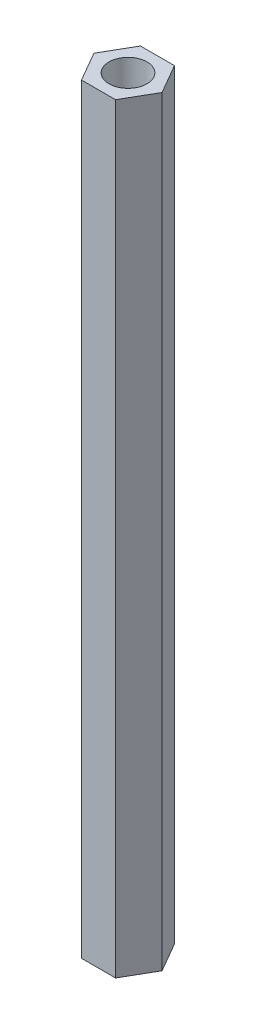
from build123d import *

# Parameters (mm, degrees)
SKETCH_1_R      = 2
EXTRUDE_1_DEPTH = 80


with BuildPart() as part:
    # Sketch 1 → Extrude 1 (new body)
    with BuildSketch(Plane(origin=(0, 0, 0), x_dir=(1, 0, 0), z_dir=(0, 1, 0))):
        Polygon((3.579571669, 0), (1.789785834, 3.1), (-1.789785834, 3.1), (-3.579571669, 0), (-1.789785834, -3.1), (1.789785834, -3.1), align=None)
        with Locations(Location((0, 0, 0), (0, 0, 270))):
            Circle(SKETCH_1_R, mode=Mode.SUBTRACT)
    extrude(amount=EXTRUDE_1_DEPTH)


solid = part.part
